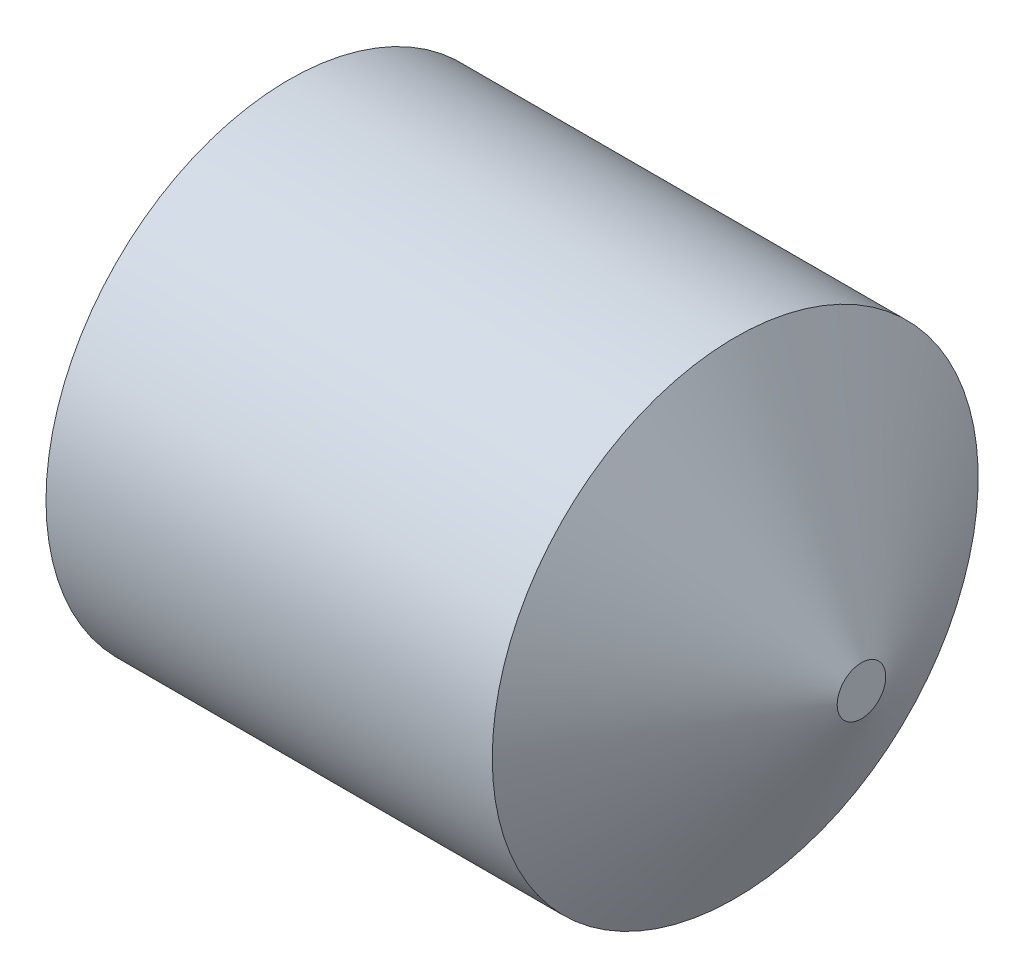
from build123d import *

# Parameters (mm, degrees)
HEXAGONSOCKET_DEPTH = 0.7


with BuildPart() as part:
    # BodySke → BaseBody (revolve)
    with BuildSketch(Plane.XY, mode=Mode.PRIVATE) as basebody_sk:
        Polygon((2, 0), (2, 0.08), (1.584307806, 0.8), (0, 0.8), (0, 0), align=None)
    revolve(basebody_sk.sketch.rotate(Axis((0, 0, 0), (1, 0, 0)), 90), axis=Axis((0, 0, 0), (1, 0, 0)))

    # HeadChamferSke → HeadChamfer (revolve, cut)
    with BuildSketch(Plane.XY, mode=Mode.PRIVATE) as headchamfer_sk:
        Polygon((0, 0.8), (0, 0.601), (0.114892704, 0.8), align=None)
    revolve(headchamfer_sk.sketch.rotate(Axis((0, 0, 0), (1, 0, 0)), 90), axis=Axis((0, 0, 0), (1, 0, 0)), mode=Mode.SUBTRACT)

    # HexagonSocketSke → HexagonSocket (cut)
    with BuildSketch(Plane.ZY):
        Polygon((0, 0.404145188), (-0.35, 0.202072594), (-0.35, -0.202072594), (0, -0.404145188), (0.35, -0.202072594), (0.35, 0.202072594), align=None)
    extrude(amount=-HEXAGONSOCKET_DEPTH, mode=Mode.SUBTRACT)


solid = part.part
